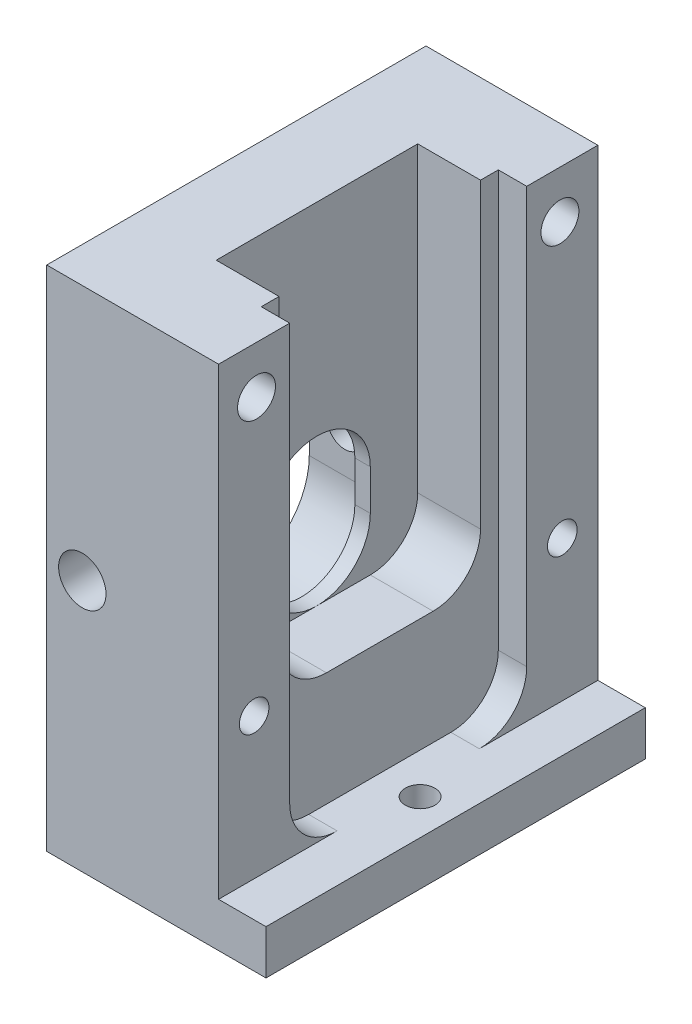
ISO-10303-21;
HEADER;
FILE_DESCRIPTION(('STEP AP214'),'2;1');
FILE_NAME('part.step','',(''),(''),'','','');
FILE_SCHEMA(('AUTOMOTIVE_DESIGN { 1 0 10303 214 1 1 1 1 }'));
ENDSEC;
DATA;
#1=APPLICATION_CONTEXT('core data for automotive mechanical design processes');
#2=APPLICATION_PROTOCOL_DEFINITION('international standard','automotive_design',2000,#1);
#3=PRODUCT_CONTEXT('',#1,'mechanical');
#4=PRODUCT('Part','Part','',(#3));
#5=PRODUCT_RELATED_PRODUCT_CATEGORY('part','',(#4));
#6=PRODUCT_DEFINITION_FORMATION('','',#4);
#7=PRODUCT_DEFINITION_CONTEXT('part definition',#1,'design');
#8=PRODUCT_DEFINITION('design','',#6,#7);
#9=PRODUCT_DEFINITION_SHAPE('','',#8);
#10=(LENGTH_UNIT() NAMED_UNIT(*) SI_UNIT(.MILLI.,.METRE.));
#11=(NAMED_UNIT(*) PLANE_ANGLE_UNIT() SI_UNIT($,.RADIAN.));
#12=(NAMED_UNIT(*) SI_UNIT($,.STERADIAN.) SOLID_ANGLE_UNIT());
#13=UNCERTAINTY_MEASURE_WITH_UNIT(LENGTH_MEASURE(1.E-05),#10,'distance_accuracy_value','');
#14=(GEOMETRIC_REPRESENTATION_CONTEXT(3) GLOBAL_UNCERTAINTY_ASSIGNED_CONTEXT((#13)) GLOBAL_UNIT_ASSIGNED_CONTEXT((#10,
#11,#12)) REPRESENTATION_CONTEXT('',''));
#15=CARTESIAN_POINT('',(0.,0.,0.));
#16=DIRECTION('',(0.,0.,1.));
#17=DIRECTION('',(1.,0.,0.));
#18=AXIS2_PLACEMENT_3D('',#15,#16,#17);
#19=CARTESIAN_POINT('',(0.,0.,32.));
#20=DIRECTION('',(1.,0.,0.));
#21=DIRECTION('',(0.,0.,-1.));
#22=AXIS2_PLACEMENT_3D('',#19,#20,#21);
#23=PLANE('',#22);
#24=CARTESIAN_POINT('',(0.,38.85,28.8));
#25=DIRECTION('',(1.,0.,0.));
#26=DIRECTION('',(0.,0.,-1.));
#27=AXIS2_PLACEMENT_3D('',#24,#25,#26);
#28=CIRCLE('',#27,3.1);
#29=CARTESIAN_POINT('',(0.,38.85,25.7));
#30=VERTEX_POINT('',#29);
#31=EDGE_CURVE('E692',#30,#30,#28,.T.);
#32=ORIENTED_EDGE('',*,*,#31,.T.);
#33=EDGE_LOOP('',(#32));
#34=FACE_BOUND('',#33,.T.);
#35=DIRECTION('',(0.,-1.,0.));
#36=VECTOR('',#35,1.);
#37=CARTESIAN_POINT('',(0.,21.25,9.85));
#38=LINE('',#37,#36);
#39=CARTESIAN_POINT('',(0.,21.25,9.85));
#40=VERTEX_POINT('',#39);
#41=CARTESIAN_POINT('',(0.,17.85,9.85));
#42=VERTEX_POINT('',#41);
#43=EDGE_CURVE('E296',#40,#42,#38,.T.);
#44=ORIENTED_EDGE('',*,*,#43,.F.);
#45=CARTESIAN_POINT('',(0.,21.25,16.));
#46=DIRECTION('',(-1.,0.,0.));
#47=DIRECTION('',(0.,0.,1.));
#48=AXIS2_PLACEMENT_3D('',#45,#46,#47);
#49=CIRCLE('',#48,6.15);
#50=CARTESIAN_POINT('',(0.,21.25,22.15));
#51=VERTEX_POINT('',#50);
#52=EDGE_CURVE('E293',#51,#40,#49,.T.);
#53=ORIENTED_EDGE('',*,*,#52,.F.);
#54=DIRECTION('',(0.,1.,0.));
#55=VECTOR('',#54,1.);
#56=CARTESIAN_POINT('',(0.,21.25,22.15));
#57=LINE('',#56,#55);
#58=CARTESIAN_POINT('',(0.,17.85,22.15));
#59=VERTEX_POINT('',#58);
#60=EDGE_CURVE('E302',#59,#51,#57,.T.);
#61=ORIENTED_EDGE('',*,*,#60,.F.);
#62=CARTESIAN_POINT('',(0.,17.85,16.));
#63=DIRECTION('',(-1.,0.,0.));
#64=DIRECTION('',(0.,0.,1.));
#65=AXIS2_PLACEMENT_3D('',#62,#63,#64);
#66=CIRCLE('',#65,6.15);
#67=EDGE_CURVE('E299',#42,#59,#66,.T.);
#68=ORIENTED_EDGE('',*,*,#67,.F.);
#69=EDGE_LOOP('',(#44,#53,#61,#68));
#70=FACE_BOUND('',#69,.T.);
#71=DIRECTION('',(0.,-1.,0.));
#72=VECTOR('',#71,1.);
#73=CARTESIAN_POINT('',(0.,0.,0.));
#74=LINE('',#73,#72);
#75=CARTESIAN_POINT('',(0.,42.85,0.));
#76=VERTEX_POINT('',#75);
#77=CARTESIAN_POINT('',(0.,0.,0.));
#78=VERTEX_POINT('',#77);
#79=EDGE_CURVE('E418',#76,#78,#74,.T.);
#80=ORIENTED_EDGE('',*,*,#79,.T.);
#81=DIRECTION('',(0.,0.,-1.));
#82=VECTOR('',#81,1.);
#83=CARTESIAN_POINT('',(0.,0.,32.));
#84=LINE('',#83,#82);
#85=CARTESIAN_POINT('',(0.,0.,32.));
#86=VERTEX_POINT('',#85);
#87=EDGE_CURVE('E433',#86,#78,#84,.T.);
#88=ORIENTED_EDGE('',*,*,#87,.F.);
#89=DIRECTION('',(0.,-1.,0.));
#90=VECTOR('',#89,1.);
#91=CARTESIAN_POINT('',(0.,0.,32.));
#92=LINE('',#91,#90);
#93=CARTESIAN_POINT('',(0.,42.85,32.));
#94=VERTEX_POINT('',#93);
#95=EDGE_CURVE('E431',#94,#86,#92,.T.);
#96=ORIENTED_EDGE('',*,*,#95,.F.);
#97=DIRECTION('',(0.,0.,-1.));
#98=VECTOR('',#97,1.);
#99=CARTESIAN_POINT('',(0.,42.85,32.));
#100=LINE('',#99,#98);
#101=EDGE_CURVE('E436',#94,#76,#100,.T.);
#102=ORIENTED_EDGE('',*,*,#101,.T.);
#103=EDGE_LOOP('',(#80,#88,#96,#102));
#104=FACE_BOUND('',#103,.T.);
#105=CARTESIAN_POINT('',(0.,38.85,3.19999999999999));
#106=DIRECTION('',(-1.,0.,0.));
#107=DIRECTION('',(0.,0.,1.));
#108=AXIS2_PLACEMENT_3D('',#105,#106,#107);
#109=CIRCLE('',#108,3.1);
#110=CARTESIAN_POINT('',(0.,38.85,6.29999999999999));
#111=VERTEX_POINT('',#110);
#112=EDGE_CURVE('E679',#111,#111,#109,.T.);
#113=ORIENTED_EDGE('',*,*,#112,.F.);
#114=EDGE_LOOP('',(#113));
#115=FACE_BOUND('',#114,.T.);
#116=ADVANCED_FACE('F29',(#34,#70,#104,#115),#23,.F.);
#117=CARTESIAN_POINT('',(14.5,42.85,32.));
#118=DIRECTION('',(-1.,0.,0.));
#119=DIRECTION('',(0.,-1.,0.));
#120=AXIS2_PLACEMENT_3D('',#117,#118,#119);
#121=PLANE('',#120);
#122=DIRECTION('',(0.,0.,-1.));
#123=VECTOR('',#122,1.);
#124=CARTESIAN_POINT('',(14.5,42.85,32.));
#125=LINE('',#124,#123);
#126=CARTESIAN_POINT('',(14.5,42.85,6.));
#127=VERTEX_POINT('',#126);
#128=CARTESIAN_POINT('',(14.5,42.85,0.));
#129=VERTEX_POINT('',#128);
#130=EDGE_CURVE('E439',#127,#129,#125,.T.);
#131=ORIENTED_EDGE('',*,*,#130,.F.);
#132=DIRECTION('',(0.,1.,0.));
#133=VECTOR('',#132,1.);
#134=CARTESIAN_POINT('',(14.5,42.85,6.));
#135=LINE('',#134,#133);
#136=CARTESIAN_POINT('',(14.5,7.74999999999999,6.));
#137=VERTEX_POINT('',#136);
#138=EDGE_CURVE('E357',#137,#127,#135,.T.);
#139=ORIENTED_EDGE('',*,*,#138,.F.);
#140=CARTESIAN_POINT('',(14.5,7.74999999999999,10.));
#141=DIRECTION('',(-1.,0.,0.));
#142=DIRECTION('',(0.,-1.,0.));
#143=AXIS2_PLACEMENT_3D('',#140,#141,#142);
#144=CIRCLE('',#143,4.);
#145=CARTESIAN_POINT('',(14.5,3.75,10.));
#146=VERTEX_POINT('',#145);
#147=EDGE_CURVE('E481',#137,#146,#144,.T.);
#148=ORIENTED_EDGE('',*,*,#147,.T.);
#149=DIRECTION('',(0.,0.,-1.));
#150=VECTOR('',#149,1.);
#151=CARTESIAN_POINT('',(14.5,3.75,32.));
#152=LINE('',#151,#150);
#153=CARTESIAN_POINT('',(14.5,3.75,0.));
#154=VERTEX_POINT('',#153);
#155=EDGE_CURVE('E443',#146,#154,#152,.T.);
#156=ORIENTED_EDGE('',*,*,#155,.T.);
#157=DIRECTION('',(0.,1.,0.));
#158=VECTOR('',#157,1.);
#159=CARTESIAN_POINT('',(14.5,42.85,0.));
#160=LINE('',#159,#158);
#161=EDGE_CURVE('E413',#154,#129,#160,.T.);
#162=ORIENTED_EDGE('',*,*,#161,.T.);
#163=EDGE_LOOP('',(#131,#139,#148,#156,#162));
#164=FACE_BOUND('',#163,.T.);
#165=CARTESIAN_POINT('',(14.5,15.65,3.));
#166=DIRECTION('',(1.,0.,0.));
#167=DIRECTION('',(0.,0.,-1.));
#168=AXIS2_PLACEMENT_3D('',#165,#166,#167);
#169=CIRCLE('',#168,1.24999999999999);
#170=CARTESIAN_POINT('',(14.5,15.65,1.75000000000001));
#171=VERTEX_POINT('',#170);
#172=EDGE_CURVE('E245',#171,#171,#169,.T.);
#173=ORIENTED_EDGE('',*,*,#172,.F.);
#174=EDGE_LOOP('',(#173));
#175=FACE_BOUND('',#174,.T.);
#176=CARTESIAN_POINT('',(14.5,38.85,3.19999999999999));
#177=DIRECTION('',(-1.,0.,0.));
#178=DIRECTION('',(0.,0.,1.));
#179=AXIS2_PLACEMENT_3D('',#176,#177,#178);
#180=CIRCLE('',#179,1.6);
#181=CARTESIAN_POINT('',(14.5,38.85,4.79999999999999));
#182=VERTEX_POINT('',#181);
#183=EDGE_CURVE('E689',#182,#182,#180,.T.);
#184=ORIENTED_EDGE('',*,*,#183,.T.);
#185=EDGE_LOOP('',(#184));
#186=FACE_BOUND('',#185,.T.);
#187=ADVANCED_FACE('F505',(#164,#175,#186),#121,.F.);
#188=CARTESIAN_POINT('',(14.5,3.75,32.));
#189=VERTEX_POINT('',#188);
#190=CARTESIAN_POINT('',(14.5,3.75,22.));
#191=VERTEX_POINT('',#190);
#192=EDGE_CURVE('E444',#189,#191,#152,.T.);
#193=ORIENTED_EDGE('',*,*,#192,.T.);
#194=CARTESIAN_POINT('',(14.5,7.75,22.));
#195=DIRECTION('',(-1.,0.,0.));
#196=DIRECTION('',(0.,-1.,0.));
#197=AXIS2_PLACEMENT_3D('',#194,#195,#196);
#198=CIRCLE('',#197,4.);
#199=CARTESIAN_POINT('',(14.5,7.74999999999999,26.));
#200=VERTEX_POINT('',#199);
#201=EDGE_CURVE('E484',#191,#200,#198,.T.);
#202=ORIENTED_EDGE('',*,*,#201,.T.);
#203=DIRECTION('',(0.,-1.,0.));
#204=VECTOR('',#203,1.);
#205=CARTESIAN_POINT('',(14.5,42.85,26.));
#206=LINE('',#205,#204);
#207=CARTESIAN_POINT('',(14.5,42.85,26.));
#208=VERTEX_POINT('',#207);
#209=EDGE_CURVE('E349',#208,#200,#206,.T.);
#210=ORIENTED_EDGE('',*,*,#209,.F.);
#211=CARTESIAN_POINT('',(14.5,42.85,32.));
#212=VERTEX_POINT('',#211);
#213=EDGE_CURVE('E440',#212,#208,#125,.T.);
#214=ORIENTED_EDGE('',*,*,#213,.F.);
#215=DIRECTION('',(0.,1.,0.));
#216=VECTOR('',#215,1.);
#217=CARTESIAN_POINT('',(14.5,42.85,32.));
#218=LINE('',#217,#216);
#219=EDGE_CURVE('E427',#189,#212,#218,.T.);
#220=ORIENTED_EDGE('',*,*,#219,.F.);
#221=EDGE_LOOP('',(#193,#202,#210,#214,#220));
#222=FACE_BOUND('',#221,.T.);
#223=CARTESIAN_POINT('',(14.5,15.65,29.));
#224=DIRECTION('',(1.,0.,0.));
#225=DIRECTION('',(0.,0.,-1.));
#226=AXIS2_PLACEMENT_3D('',#223,#224,#225);
#227=CIRCLE('',#226,1.24999999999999);
#228=CARTESIAN_POINT('',(14.5,15.65,27.75));
#229=VERTEX_POINT('',#228);
#230=EDGE_CURVE('E232',#229,#229,#227,.T.);
#231=ORIENTED_EDGE('',*,*,#230,.F.);
#232=EDGE_LOOP('',(#231));
#233=FACE_BOUND('',#232,.T.);
#234=CARTESIAN_POINT('',(14.5,38.85,28.8));
#235=DIRECTION('',(1.,0.,0.));
#236=DIRECTION('',(0.,0.,-1.));
#237=AXIS2_PLACEMENT_3D('',#234,#235,#236);
#238=CIRCLE('',#237,1.6);
#239=CARTESIAN_POINT('',(14.5,38.85,27.2));
#240=VERTEX_POINT('',#239);
#241=EDGE_CURVE('E233',#240,#240,#238,.T.);
#242=ORIENTED_EDGE('',*,*,#241,.F.);
#243=EDGE_LOOP('',(#242));
#244=FACE_BOUND('',#243,.T.);
#245=ADVANCED_FACE('F501',(#222,#233,#244),#121,.F.);
#246=CARTESIAN_POINT('',(0.,0.,0.));
#247=DIRECTION('',(0.,0.,-1.));
#248=DIRECTION('',(-1.,0.,0.));
#249=AXIS2_PLACEMENT_3D('',#246,#247,#248);
#250=PLANE('',#249);
#251=DIRECTION('',(1.,0.,0.));
#252=VECTOR('',#251,1.);
#253=CARTESIAN_POINT('',(18.5,0.,0.));
#254=LINE('',#253,#252);
#255=CARTESIAN_POINT('',(18.5,0.,0.));
#256=VERTEX_POINT('',#255);
#257=EDGE_CURVE('E403',#78,#256,#254,.T.);
#258=ORIENTED_EDGE('',*,*,#257,.F.);
#259=ORIENTED_EDGE('',*,*,#79,.F.);
#260=DIRECTION('',(-1.,0.,0.));
#261=VECTOR('',#260,1.);
#262=CARTESIAN_POINT('',(0.,42.85,0.));
#263=LINE('',#262,#261);
#264=EDGE_CURVE('E416',#129,#76,#263,.T.);
#265=ORIENTED_EDGE('',*,*,#264,.F.);
#266=ORIENTED_EDGE('',*,*,#161,.F.);
#267=DIRECTION('',(-1.,0.,0.));
#268=VECTOR('',#267,1.);
#269=CARTESIAN_POINT('',(14.5,3.75,0.));
#270=LINE('',#269,#268);
#271=CARTESIAN_POINT('',(18.5,3.75,0.));
#272=VERTEX_POINT('',#271);
#273=EDGE_CURVE('E410',#272,#154,#270,.T.);
#274=ORIENTED_EDGE('',*,*,#273,.F.);
#275=DIRECTION('',(0.,1.,0.));
#276=VECTOR('',#275,1.);
#277=CARTESIAN_POINT('',(18.5,3.75,0.));
#278=LINE('',#277,#276);
#279=EDGE_CURVE('E408',#256,#272,#278,.T.);
#280=ORIENTED_EDGE('',*,*,#279,.F.);
#281=EDGE_LOOP('',(#258,#259,#265,#266,#274,#280));
#282=FACE_BOUND('',#281,.T.);
#283=CARTESIAN_POINT('',(3.,21.3,0.));
#284=DIRECTION('',(0.,0.,1.));
#285=DIRECTION('',(1.,0.,0.));
#286=AXIS2_PLACEMENT_3D('',#283,#284,#285);
#287=CIRCLE('',#286,2.);
#288=CARTESIAN_POINT('',(5.,21.3,0.));
#289=VERTEX_POINT('',#288);
#290=EDGE_CURVE('E251',#289,#289,#287,.T.);
#291=ORIENTED_EDGE('',*,*,#290,.T.);
#292=EDGE_LOOP('',(#291));
#293=FACE_BOUND('',#292,.T.);
#294=ADVANCED_FACE('F497',(#282,#293),#250,.T.);
#295=CARTESIAN_POINT('',(3.,21.3,0.));
#296=DIRECTION('',(0.,0.,1.));
#297=DIRECTION('',(1.,0.,0.));
#298=AXIS2_PLACEMENT_3D('',#295,#296,#297);
#299=CYLINDRICAL_SURFACE('',#298,1.5);
#300=CARTESIAN_POINT('',(3.,21.3,9.85));
#301=DIRECTION('',(0.,0.,-1.));
#302=DIRECTION('',(-1.,0.,0.));
#303=AXIS2_PLACEMENT_3D('',#300,#301,#302);
#304=CIRCLE('',#303,1.5);
#305=CARTESIAN_POINT('',(4.4991664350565,21.25,9.85));
#306=VERTEX_POINT('',#305);
#307=CARTESIAN_POINT('',(1.5008335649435,21.25,9.85));
#308=VERTEX_POINT('',#307);
#309=EDGE_CURVE('E11',#306,#308,#304,.T.);
#310=ORIENTED_EDGE('',*,*,#309,.F.);
#311=CARTESIAN_POINT('',(1.5008335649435,21.25,9.84999999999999));
#312=CARTESIAN_POINT('',(1.49944944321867,21.291488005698,9.84999769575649));
#313=CARTESIAN_POINT('',(1.49979015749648,21.3330131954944,9.8504203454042));
#314=CARTESIAN_POINT('',(1.50390649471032,21.4158701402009,9.85209791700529));
#315=CARTESIAN_POINT('',(1.50768162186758,21.457201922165,9.85335271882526));
#316=CARTESIAN_POINT('',(1.52410646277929,21.5802974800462,9.85832995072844));
#317=CARTESIAN_POINT('',(1.54184823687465,21.6613925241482,9.86326540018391));
#318=CARTESIAN_POINT('',(1.59033764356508,21.8193129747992,9.87589381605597));
#319=CARTESIAN_POINT('',(1.62108540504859,21.8961383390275,9.88358680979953));
#320=CARTESIAN_POINT('',(1.69465573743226,22.0435460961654,9.90095950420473));
#321=CARTESIAN_POINT('',(1.7374808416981,22.1141271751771,9.91063962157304));
#322=CARTESIAN_POINT('',(1.83486562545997,22.2483995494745,9.93119456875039));
#323=CARTESIAN_POINT('',(1.88961791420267,22.3119483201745,9.9420873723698));
#324=CARTESIAN_POINT('',(2.00894802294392,22.4290736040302,9.96378923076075));
#325=CARTESIAN_POINT('',(2.07352786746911,22.4826480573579,9.97459826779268));
#326=CARTESIAN_POINT('',(2.21198271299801,22.5791658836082,9.99514362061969));
#327=CARTESIAN_POINT('',(2.28599344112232,22.6219193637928,10.0048593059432));
#328=CARTESIAN_POINT('',(2.44042089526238,22.6943242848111,10.0218883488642));
#329=CARTESIAN_POINT('',(2.52083637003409,22.7239782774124,10.0292021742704));
#330=CARTESIAN_POINT('',(2.68426911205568,22.7687963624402,10.0404457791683));
#331=CARTESIAN_POINT('',(2.76721298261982,22.7842129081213,10.0444343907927));
#332=CARTESIAN_POINT('',(2.93460102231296,22.8009311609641,10.0487656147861));
#333=CARTESIAN_POINT('',(3.019044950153,22.8022351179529,10.0491088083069));
#334=CARTESIAN_POINT('',(3.1846691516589,22.7908411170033,10.0461492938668));
#335=CARTESIAN_POINT('',(3.26587680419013,22.778511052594,10.0429423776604));
#336=CARTESIAN_POINT('',(3.42502172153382,22.7408483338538,10.0334059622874));
#337=CARTESIAN_POINT('',(3.50295887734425,22.7155152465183,10.0270763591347));
#338=CARTESIAN_POINT('',(3.65395980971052,22.6524333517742,10.0119508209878));
#339=CARTESIAN_POINT('',(3.7269891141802,22.6146059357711,10.0031393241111));
#340=CARTESIAN_POINT('',(3.86577085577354,22.5276599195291,9.9840162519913));
#341=CARTESIAN_POINT('',(3.93152193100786,22.4785392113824,9.97370439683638));
#342=CARTESIAN_POINT('',(4.05590432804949,22.3687129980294,9.95233977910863));
#343=CARTESIAN_POINT('',(4.11427264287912,22.307711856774,9.94127418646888));
#344=CARTESIAN_POINT('',(4.22002898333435,22.1767073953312,9.91985930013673));
#345=CARTESIAN_POINT('',(4.2674154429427,22.106702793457,9.90951010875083));
#346=CARTESIAN_POINT('',(4.35021609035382,21.9589048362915,9.89053607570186));
#347=CARTESIAN_POINT('',(4.38552226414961,21.8810488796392,9.88192705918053));
#348=CARTESIAN_POINT('',(4.44243836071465,21.7202696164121,9.86747713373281));
#349=CARTESIAN_POINT('',(4.46406082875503,21.637351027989,9.8616336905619));
#350=CARTESIAN_POINT('',(4.48704546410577,21.5031694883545,9.85500818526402));
#351=CARTESIAN_POINT('',(4.4930684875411,21.4527135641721,9.85313449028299));
#352=CARTESIAN_POINT('',(4.49997393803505,21.3514849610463,9.85062774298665));
#353=CARTESIAN_POINT('',(4.5008628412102,21.3007127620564,9.84999312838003));
#354=CARTESIAN_POINT('',(4.4991664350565,21.25,9.84999999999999));
#355=B_SPLINE_CURVE_WITH_KNOTS('',3,(#311,#312,#313,#314,#315,#316,#317,#318,#319,#320,#321,
#322,#323,#324,#325,#326,#327,#328,#329,#330,#331,#332,#333,#334,#335,#336,#337,#338,#339,#340,
#341,#342,#343,#344,#345,#346,#347,#348,#349,#350,#351,#352,#353,#354),.UNSPECIFIED.,.F.,.F.,(4,
2,2,2,2,2,2,2,2,2,2,2,2,2,2,2,2,2,2,2,2,4),(0.,0.124455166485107,0.248892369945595,
0.497082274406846,0.745274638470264,0.993519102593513,1.24611680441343,1.49876661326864,
1.75558298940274,2.01234931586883,2.26447006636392,2.51655062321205,2.76199159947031,
3.00744074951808,3.25446454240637,3.50153448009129,3.75579739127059,4.01009653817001,
4.26661342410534,4.52289479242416,4.6751888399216,4.82729074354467),.UNSPECIFIED.);
#356=EDGE_CURVE('E52',#308,#306,#355,.T.);
#357=ORIENTED_EDGE('',*,*,#356,.F.);
#358=EDGE_LOOP('',(#310,#357));
#359=FACE_BOUND('',#358,.T.);
#360=CARTESIAN_POINT('',(3.,21.3,3.74999999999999));
#361=DIRECTION('',(0.,0.,-1.));
#362=DIRECTION('',(-1.,0.,0.));
#363=AXIS2_PLACEMENT_3D('',#360,#361,#362);
#364=CIRCLE('',#363,1.5);
#365=CARTESIAN_POINT('',(1.5,21.3,3.74999999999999));
#366=VERTEX_POINT('',#365);
#367=EDGE_CURVE('E257',#366,#366,#364,.F.);
#368=ORIENTED_EDGE('',*,*,#367,.F.);
#369=EDGE_LOOP('',(#368));
#370=FACE_BOUND('',#369,.T.);
#371=ADVANCED_FACE('F283',(#359,#370),#299,.F.);
#372=CARTESIAN_POINT('',(3.,21.3,22.15));
#373=DIRECTION('',(0.,0.,1.));
#374=DIRECTION('',(1.,0.,0.));
#375=AXIS2_PLACEMENT_3D('',#372,#373,#374);
#376=CIRCLE('',#375,1.5);
#377=CARTESIAN_POINT('',(1.5008335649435,21.25,22.15));
#378=VERTEX_POINT('',#377);
#379=CARTESIAN_POINT('',(4.4991664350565,21.25,22.15));
#380=VERTEX_POINT('',#379);
#381=EDGE_CURVE('E271',#378,#380,#376,.T.);
#382=ORIENTED_EDGE('',*,*,#381,.F.);
#383=CARTESIAN_POINT('',(4.4991664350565,21.25,22.15));
#384=CARTESIAN_POINT('',(4.50055055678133,21.291488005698,22.1500023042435));
#385=CARTESIAN_POINT('',(4.50020984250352,21.3330131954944,22.1495796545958));
#386=CARTESIAN_POINT('',(4.49609350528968,21.4158701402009,22.1479020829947));
#387=CARTESIAN_POINT('',(4.49231837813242,21.457201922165,22.1466472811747));
#388=CARTESIAN_POINT('',(4.47589353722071,21.5802974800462,22.1416700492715));
#389=CARTESIAN_POINT('',(4.45815176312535,21.6613925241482,22.1367345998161));
#390=CARTESIAN_POINT('',(4.40966235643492,21.8193129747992,22.124106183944));
#391=CARTESIAN_POINT('',(4.37891459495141,21.8961383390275,22.1164131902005));
#392=CARTESIAN_POINT('',(4.30534426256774,22.0435460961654,22.0990404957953));
#393=CARTESIAN_POINT('',(4.26251915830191,22.1141271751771,22.0893603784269));
#394=CARTESIAN_POINT('',(4.16513437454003,22.2483995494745,22.0688054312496));
#395=CARTESIAN_POINT('',(4.11038208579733,22.3119483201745,22.0579126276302));
#396=CARTESIAN_POINT('',(3.99105197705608,22.4290736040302,22.0362107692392));
#397=CARTESIAN_POINT('',(3.92647213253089,22.4826480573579,22.0254017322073));
#398=CARTESIAN_POINT('',(3.788017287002,22.5791658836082,22.0048563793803));
#399=CARTESIAN_POINT('',(3.71400655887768,22.6219193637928,21.9951406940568));
#400=CARTESIAN_POINT('',(3.55957910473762,22.6943242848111,21.9781116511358));
#401=CARTESIAN_POINT('',(3.47916362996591,22.7239782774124,21.9707978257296));
#402=CARTESIAN_POINT('',(3.31573088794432,22.7687963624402,21.9595542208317));
#403=CARTESIAN_POINT('',(3.23278701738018,22.7842129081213,21.9555656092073));
#404=CARTESIAN_POINT('',(3.06539897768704,22.8009311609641,21.9512343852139));
#405=CARTESIAN_POINT('',(2.980955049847,22.8022351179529,21.9508911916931));
#406=CARTESIAN_POINT('',(2.8153308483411,22.7908411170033,21.9538507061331));
#407=CARTESIAN_POINT('',(2.73412319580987,22.778511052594,21.9570576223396));
#408=CARTESIAN_POINT('',(2.57497827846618,22.7408483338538,21.9665940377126));
#409=CARTESIAN_POINT('',(2.49704112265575,22.7155152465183,21.9729236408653));
#410=CARTESIAN_POINT('',(2.34604019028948,22.6524333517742,21.9880491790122));
#411=CARTESIAN_POINT('',(2.2730108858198,22.6146059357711,21.9968606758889));
#412=CARTESIAN_POINT('',(2.13422914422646,22.5276599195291,22.0159837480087));
#413=CARTESIAN_POINT('',(2.06847806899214,22.4785392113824,22.0262956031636));
#414=CARTESIAN_POINT('',(1.94409567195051,22.3687129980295,22.0476602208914));
#415=CARTESIAN_POINT('',(1.88572735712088,22.307711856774,22.0587258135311));
#416=CARTESIAN_POINT('',(1.77997101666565,22.1767073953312,22.0801406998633));
#417=CARTESIAN_POINT('',(1.7325845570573,22.106702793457,22.0904898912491));
#418=CARTESIAN_POINT('',(1.64978390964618,21.9589048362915,22.1094639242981));
#419=CARTESIAN_POINT('',(1.61447773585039,21.8810488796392,22.1180729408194));
#420=CARTESIAN_POINT('',(1.55756163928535,21.7202696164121,22.1325228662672));
#421=CARTESIAN_POINT('',(1.53593917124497,21.637351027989,22.1383663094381));
#422=CARTESIAN_POINT('',(1.51295453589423,21.5031694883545,22.144991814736));
#423=CARTESIAN_POINT('',(1.5069315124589,21.4527135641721,22.146865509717));
#424=CARTESIAN_POINT('',(1.50002606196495,21.3514849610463,22.1493722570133));
#425=CARTESIAN_POINT('',(1.4991371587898,21.3007127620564,22.1500068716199));
#426=CARTESIAN_POINT('',(1.5008335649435,21.25,22.15));
#427=B_SPLINE_CURVE_WITH_KNOTS('',3,(#383,#384,#385,#386,#387,#388,#389,#390,#391,#392,#393,
#394,#395,#396,#397,#398,#399,#400,#401,#402,#403,#404,#405,#406,#407,#408,#409,#410,#411,#412,
#413,#414,#415,#416,#417,#418,#419,#420,#421,#422,#423,#424,#425,#426),.UNSPECIFIED.,.F.,.F.,(4,
2,2,2,2,2,2,2,2,2,2,2,2,2,2,2,2,2,2,2,2,4),(0.,0.124455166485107,0.248892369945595,
0.497082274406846,0.745274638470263,0.993519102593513,1.24611680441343,1.49876661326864,
1.75558298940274,2.01234931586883,2.26447006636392,2.51655062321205,2.76199159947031,
3.00744074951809,3.25446454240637,3.50153448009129,3.75579739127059,4.01009653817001,
4.26661342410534,4.52289479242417,4.6751888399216,4.82729074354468),.UNSPECIFIED.);
#428=EDGE_CURVE('E45',#380,#378,#427,.T.);
#429=ORIENTED_EDGE('',*,*,#428,.F.);
#430=EDGE_LOOP('',(#382,#429));
#431=FACE_BOUND('',#430,.T.);
#432=CARTESIAN_POINT('',(3.,21.3,28.25));
#433=DIRECTION('',(0.,0.,1.));
#434=DIRECTION('',(1.,0.,0.));
#435=AXIS2_PLACEMENT_3D('',#432,#433,#434);
#436=CIRCLE('',#435,1.5);
#437=CARTESIAN_POINT('',(4.5,21.3,28.25));
#438=VERTEX_POINT('',#437);
#439=EDGE_CURVE('E264',#438,#438,#436,.F.);
#440=ORIENTED_EDGE('',*,*,#439,.F.);
#441=EDGE_LOOP('',(#440));
#442=FACE_BOUND('',#441,.T.);
#443=ADVANCED_FACE('F277',(#431,#442),#299,.F.);
#444=CARTESIAN_POINT('',(0.,17.85,16.));
#445=DIRECTION('',(1.,0.,0.));
#446=DIRECTION('',(0.,1.,0.));
#447=AXIS2_PLACEMENT_3D('',#444,#445,#446);
#448=CYLINDRICAL_SURFACE('',#447,4.5);
#449=CARTESIAN_POINT('',(5.5,17.85,16.));
#450=DIRECTION('',(-1.,0.,0.));
#451=DIRECTION('',(0.,0.,1.));
#452=AXIS2_PLACEMENT_3D('',#449,#450,#451);
#453=CIRCLE('',#452,4.5);
#454=CARTESIAN_POINT('',(5.5,17.85,20.5));
#455=VERTEX_POINT('',#454);
#456=CARTESIAN_POINT('',(5.5,17.85,11.5));
#457=VERTEX_POINT('',#456);
#458=EDGE_CURVE('E333',#455,#457,#453,.F.);
#459=ORIENTED_EDGE('',*,*,#458,.F.);
#460=DIRECTION('',(1.,0.,0.));
#461=VECTOR('',#460,1.);
#462=CARTESIAN_POINT('',(0.,17.85,20.5));
#463=LINE('',#462,#461);
#464=CARTESIAN_POINT('',(6.8,17.85,20.5));
#465=VERTEX_POINT('',#464);
#466=EDGE_CURVE('E347',#455,#465,#463,.T.);
#467=ORIENTED_EDGE('',*,*,#466,.T.);
#468=CARTESIAN_POINT('',(6.8,17.85,16.));
#469=DIRECTION('',(1.,0.,0.));
#470=DIRECTION('',(0.,1.,0.));
#471=AXIS2_PLACEMENT_3D('',#468,#469,#470);
#472=CIRCLE('',#471,4.5);
#473=CARTESIAN_POINT('',(6.80000000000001,13.35,16.));
#474=VERTEX_POINT('',#473);
#475=EDGE_CURVE('E335',#465,#474,#472,.T.);
#476=ORIENTED_EDGE('',*,*,#475,.T.);
#477=CARTESIAN_POINT('',(6.8,17.85,16.));
#478=DIRECTION('',(1.,0.,0.));
#479=DIRECTION('',(0.,1.,0.));
#480=AXIS2_PLACEMENT_3D('',#477,#478,#479);
#481=CIRCLE('',#480,4.5);
#482=CARTESIAN_POINT('',(6.8,17.85,11.5));
#483=VERTEX_POINT('',#482);
#484=EDGE_CURVE('E486',#474,#483,#481,.T.);
#485=ORIENTED_EDGE('',*,*,#484,.T.);
#486=DIRECTION('',(1.,0.,0.));
#487=VECTOR('',#486,1.);
#488=CARTESIAN_POINT('',(0.,17.85,11.5));
#489=LINE('',#488,#487);
#490=EDGE_CURVE('E346',#457,#483,#489,.T.);
#491=ORIENTED_EDGE('',*,*,#490,.F.);
#492=EDGE_LOOP('',(#459,#467,#476,#485,#491));
#493=FACE_BOUND('',#492,.T.);
#494=ADVANCED_FACE('F282',(#493),#448,.F.);
#495=CARTESIAN_POINT('',(0.,17.85,20.5));
#496=DIRECTION('',(0.,0.,1.));
#497=DIRECTION('',(1.,0.,0.));
#498=AXIS2_PLACEMENT_3D('',#495,#496,#497);
#499=PLANE('',#498);
#500=DIRECTION('',(0.,-1.,0.));
#501=VECTOR('',#500,1.);
#502=CARTESIAN_POINT('',(5.5,17.85,20.5));
#503=LINE('',#502,#501);
#504=CARTESIAN_POINT('',(5.5,21.25,20.5));
#505=VERTEX_POINT('',#504);
#506=EDGE_CURVE('E331',#505,#455,#503,.T.);
#507=ORIENTED_EDGE('',*,*,#506,.F.);
#508=DIRECTION('',(1.,0.,0.));
#509=VECTOR('',#508,1.);
#510=CARTESIAN_POINT('',(0.,21.25,20.5));
#511=LINE('',#510,#509);
#512=CARTESIAN_POINT('',(6.8,21.25,20.5));
#513=VERTEX_POINT('',#512);
#514=EDGE_CURVE('E350',#505,#513,#511,.T.);
#515=ORIENTED_EDGE('',*,*,#514,.T.);
#516=DIRECTION('',(0.,-1.,0.));
#517=VECTOR('',#516,1.);
#518=CARTESIAN_POINT('',(6.8,17.85,20.5));
#519=LINE('',#518,#517);
#520=EDGE_CURVE('E343',#513,#465,#519,.T.);
#521=ORIENTED_EDGE('',*,*,#520,.T.);
#522=ORIENTED_EDGE('',*,*,#466,.F.);
#523=EDGE_LOOP('',(#507,#515,#521,#522));
#524=FACE_BOUND('',#523,.T.);
#525=ADVANCED_FACE('F629',(#524),#499,.F.);
#526=CARTESIAN_POINT('',(0.,21.25,16.));
#527=DIRECTION('',(1.,0.,0.));
#528=DIRECTION('',(0.,1.,0.));
#529=AXIS2_PLACEMENT_3D('',#526,#527,#528);
#530=CYLINDRICAL_SURFACE('',#529,4.5);
#531=CARTESIAN_POINT('',(5.5,21.25,16.));
#532=DIRECTION('',(-1.,0.,0.));
#533=DIRECTION('',(0.,0.,1.));
#534=AXIS2_PLACEMENT_3D('',#531,#532,#533);
#535=CIRCLE('',#534,4.5);
#536=CARTESIAN_POINT('',(5.5,21.25,11.5));
#537=VERTEX_POINT('',#536);
#538=EDGE_CURVE('E321',#537,#505,#535,.F.);
#539=ORIENTED_EDGE('',*,*,#538,.F.);
#540=DIRECTION('',(1.,0.,0.));
#541=VECTOR('',#540,1.);
#542=CARTESIAN_POINT('',(0.,21.25,11.5));
#543=LINE('',#542,#541);
#544=CARTESIAN_POINT('',(6.8,21.25,11.5));
#545=VERTEX_POINT('',#544);
#546=EDGE_CURVE('E352',#537,#545,#543,.T.);
#547=ORIENTED_EDGE('',*,*,#546,.T.);
#548=CARTESIAN_POINT('',(6.8,21.25,16.));
#549=DIRECTION('',(1.,0.,0.));
#550=DIRECTION('',(0.,1.,0.));
#551=AXIS2_PLACEMENT_3D('',#548,#549,#550);
#552=CIRCLE('',#551,4.5);
#553=EDGE_CURVE('E340',#545,#513,#552,.T.);
#554=ORIENTED_EDGE('',*,*,#553,.T.);
#555=ORIENTED_EDGE('',*,*,#514,.F.);
#556=EDGE_LOOP('',(#539,#547,#554,#555));
#557=FACE_BOUND('',#556,.T.);
#558=ADVANCED_FACE('F602',(#557),#530,.F.);
#559=CARTESIAN_POINT('',(0.,17.85,11.5));
#560=DIRECTION('',(0.,0.,-1.));
#561=DIRECTION('',(-1.,0.,0.));
#562=AXIS2_PLACEMENT_3D('',#559,#560,#561);
#563=PLANE('',#562);
#564=DIRECTION('',(0.,1.,0.));
#565=VECTOR('',#564,1.);
#566=CARTESIAN_POINT('',(5.5,17.85,11.5));
#567=LINE('',#566,#565);
#568=EDGE_CURVE('E38',#457,#537,#567,.T.);
#569=ORIENTED_EDGE('',*,*,#568,.F.);
#570=ORIENTED_EDGE('',*,*,#490,.T.);
#571=DIRECTION('',(0.,1.,0.));
#572=VECTOR('',#571,1.);
#573=CARTESIAN_POINT('',(6.8,17.85,11.5));
#574=LINE('',#573,#572);
#575=EDGE_CURVE('E337',#483,#545,#574,.T.);
#576=ORIENTED_EDGE('',*,*,#575,.T.);
#577=ORIENTED_EDGE('',*,*,#546,.F.);
#578=EDGE_LOOP('',(#569,#570,#576,#577));
#579=FACE_BOUND('',#578,.T.);
#580=ADVANCED_FACE('F595',(#579),#563,.F.);
#581=CARTESIAN_POINT('',(6.8,42.85,24.5));
#582=DIRECTION('',(0.,0.,1.));
#583=DIRECTION('',(0.,-1.,0.));
#584=AXIS2_PLACEMENT_3D('',#581,#582,#583);
#585=PLANE('',#584);
#586=DIRECTION('',(0.,1.,0.));
#587=VECTOR('',#586,1.);
#588=CARTESIAN_POINT('',(12.1,42.85,24.5));
#589=LINE('',#588,#587);
#590=CARTESIAN_POINT('',(12.1,17.35,24.5));
#591=VERTEX_POINT('',#590);
#592=CARTESIAN_POINT('',(12.1,42.85,24.5));
#593=VERTEX_POINT('',#592);
#594=EDGE_CURVE('E367',#591,#593,#589,.T.);
#595=ORIENTED_EDGE('',*,*,#594,.F.);
#596=DIRECTION('',(1.,0.,0.));
#597=VECTOR('',#596,1.);
#598=CARTESIAN_POINT('',(6.8,17.35,24.5));
#599=LINE('',#598,#597);
#600=CARTESIAN_POINT('',(6.8,17.35,24.5));
#601=VERTEX_POINT('',#600);
#602=EDGE_CURVE('E458',#591,#601,#599,.F.);
#603=ORIENTED_EDGE('',*,*,#602,.T.);
#604=DIRECTION('',(0.,-1.,0.));
#605=VECTOR('',#604,1.);
#606=CARTESIAN_POINT('',(6.8,42.85,24.5));
#607=LINE('',#606,#605);
#608=CARTESIAN_POINT('',(6.8,42.85,24.5));
#609=VERTEX_POINT('',#608);
#610=EDGE_CURVE('E386',#609,#601,#607,.T.);
#611=ORIENTED_EDGE('',*,*,#610,.F.);
#612=DIRECTION('',(1.,0.,0.));
#613=VECTOR('',#612,1.);
#614=CARTESIAN_POINT('',(6.8,42.85,24.5));
#615=LINE('',#614,#613);
#616=EDGE_CURVE('E400',#609,#593,#615,.T.);
#617=ORIENTED_EDGE('',*,*,#616,.T.);
#618=EDGE_LOOP('',(#595,#603,#611,#617));
#619=FACE_BOUND('',#618,.T.);
#620=ADVANCED_FACE('F593',(#619),#585,.F.);
#621=CARTESIAN_POINT('',(6.8,42.85,7.5));
#622=DIRECTION('',(0.,0.,-1.));
#623=DIRECTION('',(0.,1.,0.));
#624=AXIS2_PLACEMENT_3D('',#621,#622,#623);
#625=PLANE('',#624);
#626=DIRECTION('',(0.,-1.,0.));
#627=VECTOR('',#626,1.);
#628=CARTESIAN_POINT('',(12.1,17.35,7.5));
#629=LINE('',#628,#627);
#630=CARTESIAN_POINT('',(12.1,42.85,7.5));
#631=VERTEX_POINT('',#630);
#632=CARTESIAN_POINT('',(12.1,17.35,7.5));
#633=VERTEX_POINT('',#632);
#634=EDGE_CURVE('E359',#631,#633,#629,.T.);
#635=ORIENTED_EDGE('',*,*,#634,.F.);
#636=DIRECTION('',(1.,0.,0.));
#637=VECTOR('',#636,1.);
#638=CARTESIAN_POINT('',(6.8,42.85,7.5));
#639=LINE('',#638,#637);
#640=CARTESIAN_POINT('',(6.8,42.85,7.5));
#641=VERTEX_POINT('',#640);
#642=EDGE_CURVE('E399',#641,#631,#639,.T.);
#643=ORIENTED_EDGE('',*,*,#642,.F.);
#644=DIRECTION('',(0.,1.,0.));
#645=VECTOR('',#644,1.);
#646=CARTESIAN_POINT('',(6.8,42.85,7.5));
#647=LINE('',#646,#645);
#648=CARTESIAN_POINT('',(6.8,17.35,7.5));
#649=VERTEX_POINT('',#648);
#650=EDGE_CURVE('E394',#649,#641,#647,.T.);
#651=ORIENTED_EDGE('',*,*,#650,.F.);
#652=DIRECTION('',(1.,0.,0.));
#653=VECTOR('',#652,1.);
#654=CARTESIAN_POINT('',(14.5,17.35,7.5));
#655=LINE('',#654,#653);
#656=EDGE_CURVE('E464',#649,#633,#655,.T.);
#657=ORIENTED_EDGE('',*,*,#656,.T.);
#658=EDGE_LOOP('',(#635,#643,#651,#657));
#659=FACE_BOUND('',#658,.T.);
#660=ADVANCED_FACE('F568',(#659),#625,.F.);
#661=CARTESIAN_POINT('',(6.8,13.35,24.5));
#662=DIRECTION('',(0.,-1.,0.));
#663=DIRECTION('',(1.,0.,0.));
#664=AXIS2_PLACEMENT_3D('',#661,#662,#663);
#665=PLANE('',#664);
#666=DIRECTION('',(0.,0.,1.));
#667=VECTOR('',#666,1.);
#668=CARTESIAN_POINT('',(12.1,13.35,20.5));
#669=LINE('',#668,#667);
#670=CARTESIAN_POINT('',(12.1,13.35,11.5));
#671=VERTEX_POINT('',#670);
#672=CARTESIAN_POINT('',(12.1,13.35,20.5));
#673=VERTEX_POINT('',#672);
#674=EDGE_CURVE('E363',#671,#673,#669,.T.);
#675=ORIENTED_EDGE('',*,*,#674,.F.);
#676=DIRECTION('',(1.,0.,0.));
#677=VECTOR('',#676,1.);
#678=CARTESIAN_POINT('',(6.8,13.35,11.5));
#679=LINE('',#678,#677);
#680=CARTESIAN_POINT('',(6.8,13.35,11.5));
#681=VERTEX_POINT('',#680);
#682=EDGE_CURVE('E452',#671,#681,#679,.F.);
#683=ORIENTED_EDGE('',*,*,#682,.T.);
#684=DIRECTION('',(0.,0.,-1.));
#685=VECTOR('',#684,1.);
#686=CARTESIAN_POINT('',(6.8,13.35,24.5));
#687=LINE('',#686,#685);
#688=EDGE_CURVE('E390',#474,#681,#687,.T.);
#689=ORIENTED_EDGE('',*,*,#688,.F.);
#690=CARTESIAN_POINT('',(6.8,13.35,20.5));
#691=VERTEX_POINT('',#690);
#692=EDGE_CURVE('E391',#691,#474,#687,.T.);
#693=ORIENTED_EDGE('',*,*,#692,.F.);
#694=DIRECTION('',(1.,0.,0.));
#695=VECTOR('',#694,1.);
#696=CARTESIAN_POINT('',(14.5,13.35,20.5));
#697=LINE('',#696,#695);
#698=EDGE_CURVE('E455',#691,#673,#697,.T.);
#699=ORIENTED_EDGE('',*,*,#698,.T.);
#700=EDGE_LOOP('',(#675,#683,#689,#693,#699));
#701=FACE_BOUND('',#700,.T.);
#702=ADVANCED_FACE('F584',(#701),#665,.F.);
#703=CARTESIAN_POINT('',(6.8,17.35,20.5));
#704=DIRECTION('',(-1.,0.,0.));
#705=DIRECTION('',(0.,-1.,0.));
#706=AXIS2_PLACEMENT_3D('',#703,#704,#705);
#707=CYLINDRICAL_SURFACE('',#706,4.);
#708=CARTESIAN_POINT('',(12.1,17.35,20.5));
#709=DIRECTION('',(-1.,0.,0.));
#710=DIRECTION('',(0.,1.,0.));
#711=AXIS2_PLACEMENT_3D('',#708,#709,#710);
#712=CIRCLE('',#711,4.);
#713=EDGE_CURVE('E365',#673,#591,#712,.T.);
#714=ORIENTED_EDGE('',*,*,#713,.F.);
#715=ORIENTED_EDGE('',*,*,#698,.F.);
#716=CARTESIAN_POINT('',(6.8,17.35,20.5));
#717=DIRECTION('',(1.,0.,0.));
#718=DIRECTION('',(0.,1.,0.));
#719=AXIS2_PLACEMENT_3D('',#716,#717,#718);
#720=CIRCLE('',#719,4.);
#721=EDGE_CURVE('E462',#601,#691,#720,.T.);
#722=ORIENTED_EDGE('',*,*,#721,.F.);
#723=ORIENTED_EDGE('',*,*,#602,.F.);
#724=EDGE_LOOP('',(#714,#715,#722,#723));
#725=FACE_BOUND('',#724,.T.);
#726=ADVANCED_FACE('F589',(#725),#707,.F.);
#727=CARTESIAN_POINT('',(6.8,17.35,11.5));
#728=DIRECTION('',(-1.,0.,0.));
#729=DIRECTION('',(0.,-1.,0.));
#730=AXIS2_PLACEMENT_3D('',#727,#728,#729);
#731=CYLINDRICAL_SURFACE('',#730,4.);
#732=CARTESIAN_POINT('',(12.1,17.35,11.5));
#733=DIRECTION('',(-1.,0.,0.));
#734=DIRECTION('',(0.,1.,0.));
#735=AXIS2_PLACEMENT_3D('',#732,#733,#734);
#736=CIRCLE('',#735,4.);
#737=EDGE_CURVE('E361',#633,#671,#736,.T.);
#738=ORIENTED_EDGE('',*,*,#737,.F.);
#739=ORIENTED_EDGE('',*,*,#656,.F.);
#740=CARTESIAN_POINT('',(6.8,17.35,11.5));
#741=DIRECTION('',(1.,0.,0.));
#742=DIRECTION('',(0.,1.,0.));
#743=AXIS2_PLACEMENT_3D('',#740,#741,#742);
#744=CIRCLE('',#743,4.);
#745=EDGE_CURVE('E460',#681,#649,#744,.T.);
#746=ORIENTED_EDGE('',*,*,#745,.F.);
#747=ORIENTED_EDGE('',*,*,#682,.F.);
#748=EDGE_LOOP('',(#738,#739,#746,#747));
#749=FACE_BOUND('',#748,.T.);
#750=ADVANCED_FACE('F533',(#749),#731,.F.);
#751=CARTESIAN_POINT('',(18.5,0.,32.));
#752=DIRECTION('',(0.,1.,0.));
#753=DIRECTION('',(-1.,0.,0.));
#754=AXIS2_PLACEMENT_3D('',#751,#752,#753);
#755=PLANE('',#754);
#756=CARTESIAN_POINT('',(15.5,0.,16.));
#757=DIRECTION('',(0.,-1.,0.));
#758=DIRECTION('',(0.,0.,-1.));
#759=AXIS2_PLACEMENT_3D('',#756,#757,#758);
#760=CIRCLE('',#759,1.24999999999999);
#761=CARTESIAN_POINT('',(15.5,0.,14.75));
#762=VERTEX_POINT('',#761);
#763=EDGE_CURVE('E248',#762,#762,#760,.T.);
#764=ORIENTED_EDGE('',*,*,#763,.F.);
#765=EDGE_LOOP('',(#764));
#766=FACE_BOUND('',#765,.T.);
#767=ORIENTED_EDGE('',*,*,#257,.T.);
#768=DIRECTION('',(0.,0.,-1.));
#769=VECTOR('',#768,1.);
#770=CARTESIAN_POINT('',(18.5,0.,32.));
#771=LINE('',#770,#769);
#772=CARTESIAN_POINT('',(18.5,0.,32.));
#773=VERTEX_POINT('',#772);
#774=EDGE_CURVE('E449',#773,#256,#771,.T.);
#775=ORIENTED_EDGE('',*,*,#774,.F.);
#776=DIRECTION('',(1.,0.,0.));
#777=VECTOR('',#776,1.);
#778=CARTESIAN_POINT('',(18.5,0.,32.));
#779=LINE('',#778,#777);
#780=EDGE_CURVE('E420',#86,#773,#779,.T.);
#781=ORIENTED_EDGE('',*,*,#780,.F.);
#782=ORIENTED_EDGE('',*,*,#87,.T.);
#783=EDGE_LOOP('',(#767,#775,#781,#782));
#784=FACE_BOUND('',#783,.T.);
#785=ADVANCED_FACE('F31',(#766,#784),#755,.F.);
#786=CARTESIAN_POINT('',(18.5,3.75,32.));
#787=DIRECTION('',(-1.,0.,0.));
#788=DIRECTION('',(0.,0.,1.));
#789=AXIS2_PLACEMENT_3D('',#786,#787,#788);
#790=PLANE('',#789);
#791=ORIENTED_EDGE('',*,*,#279,.T.);
#792=DIRECTION('',(0.,0.,-1.));
#793=VECTOR('',#792,1.);
#794=CARTESIAN_POINT('',(18.5,3.75,32.));
#795=LINE('',#794,#793);
#796=CARTESIAN_POINT('',(18.5,3.75,32.));
#797=VERTEX_POINT('',#796);
#798=EDGE_CURVE('E446',#797,#272,#795,.T.);
#799=ORIENTED_EDGE('',*,*,#798,.F.);
#800=DIRECTION('',(0.,1.,0.));
#801=VECTOR('',#800,1.);
#802=CARTESIAN_POINT('',(18.5,3.75,32.));
#803=LINE('',#802,#801);
#804=EDGE_CURVE('E423',#773,#797,#803,.T.);
#805=ORIENTED_EDGE('',*,*,#804,.F.);
#806=ORIENTED_EDGE('',*,*,#774,.T.);
#807=EDGE_LOOP('',(#791,#799,#805,#806));
#808=FACE_BOUND('',#807,.T.);
#809=ADVANCED_FACE('F526',(#808),#790,.F.);
#810=CARTESIAN_POINT('',(14.5,3.75,32.));
#811=DIRECTION('',(0.,-1.,0.));
#812=DIRECTION('',(0.,0.,-1.));
#813=AXIS2_PLACEMENT_3D('',#810,#811,#812);
#814=PLANE('',#813);
#815=CARTESIAN_POINT('',(15.5,3.75,16.));
#816=DIRECTION('',(0.,-1.,0.));
#817=DIRECTION('',(0.,0.,-1.));
#818=AXIS2_PLACEMENT_3D('',#815,#816,#817);
#819=CIRCLE('',#818,1.24999999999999);
#820=CARTESIAN_POINT('',(15.5,3.75,14.75));
#821=VERTEX_POINT('',#820);
#822=EDGE_CURVE('E33',#821,#821,#819,.T.);
#823=ORIENTED_EDGE('',*,*,#822,.T.);
#824=EDGE_LOOP('',(#823));
#825=FACE_BOUND('',#824,.T.);
#826=ORIENTED_EDGE('',*,*,#155,.F.);
#827=DIRECTION('',(1.,0.,0.));
#828=VECTOR('',#827,1.);
#829=CARTESIAN_POINT('',(12.1,3.75,10.));
#830=LINE('',#829,#828);
#831=CARTESIAN_POINT('',(12.1,3.75,10.));
#832=VERTEX_POINT('',#831);
#833=EDGE_CURVE('E473',#146,#832,#830,.F.);
#834=ORIENTED_EDGE('',*,*,#833,.T.);
#835=DIRECTION('',(0.,0.,-1.));
#836=VECTOR('',#835,1.);
#837=CARTESIAN_POINT('',(12.1,3.75,26.));
#838=LINE('',#837,#836);
#839=CARTESIAN_POINT('',(12.1,3.75,22.));
#840=VERTEX_POINT('',#839);
#841=EDGE_CURVE('E375',#840,#832,#838,.T.);
#842=ORIENTED_EDGE('',*,*,#841,.F.);
#843=DIRECTION('',(1.,0.,0.));
#844=VECTOR('',#843,1.);
#845=CARTESIAN_POINT('',(14.5,3.75,22.));
#846=LINE('',#845,#844);
#847=EDGE_CURVE('E470',#840,#191,#846,.T.);
#848=ORIENTED_EDGE('',*,*,#847,.T.);
#849=ORIENTED_EDGE('',*,*,#192,.F.);
#850=DIRECTION('',(-1.,0.,0.));
#851=VECTOR('',#850,1.);
#852=CARTESIAN_POINT('',(14.5,3.75,32.));
#853=LINE('',#852,#851);
#854=EDGE_CURVE('E425',#797,#189,#853,.T.);
#855=ORIENTED_EDGE('',*,*,#854,.F.);
#856=ORIENTED_EDGE('',*,*,#798,.T.);
#857=ORIENTED_EDGE('',*,*,#273,.T.);
#858=EDGE_LOOP('',(#826,#834,#842,#848,#849,#855,#856,#857));
#859=FACE_BOUND('',#858,.T.);
#860=ADVANCED_FACE('F520',(#825,#859),#814,.F.);
#861=CARTESIAN_POINT('',(0.,42.85,32.));
#862=DIRECTION('',(0.,-1.,0.));
#863=DIRECTION('',(0.,0.,-1.));
#864=AXIS2_PLACEMENT_3D('',#861,#862,#863);
#865=PLANE('',#864);
#866=DIRECTION('',(0.,0.,1.));
#867=VECTOR('',#866,1.);
#868=CARTESIAN_POINT('',(12.1,42.85,7.5));
#869=LINE('',#868,#867);
#870=CARTESIAN_POINT('',(12.1,42.85,6.));
#871=VERTEX_POINT('',#870);
#872=EDGE_CURVE('E380',#871,#631,#869,.T.);
#873=ORIENTED_EDGE('',*,*,#872,.F.);
#874=DIRECTION('',(1.,0.,0.));
#875=VECTOR('',#874,1.);
#876=CARTESIAN_POINT('',(12.1,42.85,6.));
#877=LINE('',#876,#875);
#878=EDGE_CURVE('E383',#871,#127,#877,.T.);
#879=ORIENTED_EDGE('',*,*,#878,.T.);
#880=ORIENTED_EDGE('',*,*,#130,.T.);
#881=ORIENTED_EDGE('',*,*,#264,.T.);
#882=ORIENTED_EDGE('',*,*,#101,.F.);
#883=DIRECTION('',(-1.,0.,0.));
#884=VECTOR('',#883,1.);
#885=CARTESIAN_POINT('',(0.,42.85,32.));
#886=LINE('',#885,#884);
#887=EDGE_CURVE('E429',#212,#94,#886,.T.);
#888=ORIENTED_EDGE('',*,*,#887,.F.);
#889=ORIENTED_EDGE('',*,*,#213,.T.);
#890=DIRECTION('',(1.,0.,0.));
#891=VECTOR('',#890,1.);
#892=CARTESIAN_POINT('',(12.1,42.85,26.));
#893=LINE('',#892,#891);
#894=CARTESIAN_POINT('',(12.1,42.85,26.));
#895=VERTEX_POINT('',#894);
#896=EDGE_CURVE('E382',#895,#208,#893,.T.);
#897=ORIENTED_EDGE('',*,*,#896,.F.);
#898=DIRECTION('',(0.,0.,1.));
#899=VECTOR('',#898,1.);
#900=CARTESIAN_POINT('',(12.1,42.85,26.));
#901=LINE('',#900,#899);
#902=EDGE_CURVE('E369',#593,#895,#901,.T.);
#903=ORIENTED_EDGE('',*,*,#902,.F.);
#904=ORIENTED_EDGE('',*,*,#616,.F.);
#905=DIRECTION('',(0.,0.,1.));
#906=VECTOR('',#905,1.);
#907=CARTESIAN_POINT('',(6.8,42.85,24.5));
#908=LINE('',#907,#906);
#909=EDGE_CURVE('E396',#641,#609,#908,.T.);
#910=ORIENTED_EDGE('',*,*,#909,.F.);
#911=ORIENTED_EDGE('',*,*,#642,.T.);
#912=EDGE_LOOP('',(#873,#879,#880,#881,#882,#888,#889,#897,#903,#904,#910,#911));
#913=FACE_BOUND('',#912,.T.);
#914=ADVANCED_FACE('F518',(#913),#865,.F.);
#915=CARTESIAN_POINT('',(0.,0.,32.));
#916=DIRECTION('',(0.,0.,-1.));
#917=DIRECTION('',(-1.,0.,0.));
#918=AXIS2_PLACEMENT_3D('',#915,#916,#917);
#919=PLANE('',#918);
#920=CARTESIAN_POINT('',(3.,21.3,32.));
#921=DIRECTION('',(0.,0.,1.));
#922=DIRECTION('',(1.,0.,0.));
#923=AXIS2_PLACEMENT_3D('',#920,#921,#922);
#924=CIRCLE('',#923,2.);
#925=CARTESIAN_POINT('',(5.,21.3,32.));
#926=VERTEX_POINT('',#925);
#927=EDGE_CURVE('E258',#926,#926,#924,.T.);
#928=ORIENTED_EDGE('',*,*,#927,.F.);
#929=EDGE_LOOP('',(#928));
#930=FACE_BOUND('',#929,.T.);
#931=ORIENTED_EDGE('',*,*,#780,.T.);
#932=ORIENTED_EDGE('',*,*,#804,.T.);
#933=ORIENTED_EDGE('',*,*,#854,.T.);
#934=ORIENTED_EDGE('',*,*,#219,.T.);
#935=ORIENTED_EDGE('',*,*,#887,.T.);
#936=ORIENTED_EDGE('',*,*,#95,.T.);
#937=EDGE_LOOP('',(#931,#932,#933,#934,#935,#936));
#938=FACE_BOUND('',#937,.T.);
#939=ADVANCED_FACE('F517',(#930,#938),#919,.F.);
#940=CARTESIAN_POINT('',(6.8,42.85,24.5));
#941=DIRECTION('',(1.,0.,0.));
#942=DIRECTION('',(0.,1.,0.));
#943=AXIS2_PLACEMENT_3D('',#940,#941,#942);
#944=PLANE('',#943);
#945=ORIENTED_EDGE('',*,*,#475,.F.);
#946=ORIENTED_EDGE('',*,*,#520,.F.);
#947=ORIENTED_EDGE('',*,*,#553,.F.);
#948=ORIENTED_EDGE('',*,*,#575,.F.);
#949=ORIENTED_EDGE('',*,*,#484,.F.);
#950=ORIENTED_EDGE('',*,*,#688,.T.);
#951=ORIENTED_EDGE('',*,*,#745,.T.);
#952=ORIENTED_EDGE('',*,*,#650,.T.);
#953=ORIENTED_EDGE('',*,*,#909,.T.);
#954=ORIENTED_EDGE('',*,*,#610,.T.);
#955=ORIENTED_EDGE('',*,*,#721,.T.);
#956=ORIENTED_EDGE('',*,*,#692,.T.);
#957=EDGE_LOOP('',(#945,#946,#947,#948,#949,#950,#951,#952,#953,#954,#955,#956));
#958=FACE_BOUND('',#957,.T.);
#959=ADVANCED_FACE('F576',(#958),#944,.T.);
#960=CARTESIAN_POINT('',(12.1,42.85,6.));
#961=DIRECTION('',(0.,0.,-1.));
#962=DIRECTION('',(0.,1.,0.));
#963=AXIS2_PLACEMENT_3D('',#960,#961,#962);
#964=PLANE('',#963);
#965=DIRECTION('',(0.,1.,0.));
#966=VECTOR('',#965,1.);
#967=CARTESIAN_POINT('',(12.1,42.85,6.));
#968=LINE('',#967,#966);
#969=CARTESIAN_POINT('',(12.1,7.74999999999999,6.));
#970=VERTEX_POINT('',#969);
#971=EDGE_CURVE('E378',#970,#871,#968,.T.);
#972=ORIENTED_EDGE('',*,*,#971,.F.);
#973=DIRECTION('',(1.,0.,0.));
#974=VECTOR('',#973,1.);
#975=CARTESIAN_POINT('',(14.5,7.74999999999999,6.));
#976=LINE('',#975,#974);
#977=EDGE_CURVE('E467',#970,#137,#976,.T.);
#978=ORIENTED_EDGE('',*,*,#977,.T.);
#979=ORIENTED_EDGE('',*,*,#138,.T.);
#980=ORIENTED_EDGE('',*,*,#878,.F.);
#981=EDGE_LOOP('',(#972,#978,#979,#980));
#982=FACE_BOUND('',#981,.T.);
#983=ADVANCED_FACE('F561',(#982),#964,.F.);
#984=CARTESIAN_POINT('',(12.1,42.85,26.));
#985=DIRECTION('',(0.,0.,1.));
#986=DIRECTION('',(1.,0.,0.));
#987=AXIS2_PLACEMENT_3D('',#984,#985,#986);
#988=PLANE('',#987);
#989=ORIENTED_EDGE('',*,*,#209,.T.);
#990=DIRECTION('',(1.,0.,0.));
#991=VECTOR('',#990,1.);
#992=CARTESIAN_POINT('',(12.1,7.75,26.));
#993=LINE('',#992,#991);
#994=CARTESIAN_POINT('',(12.1,7.74999999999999,26.));
#995=VERTEX_POINT('',#994);
#996=EDGE_CURVE('E479',#200,#995,#993,.F.);
#997=ORIENTED_EDGE('',*,*,#996,.T.);
#998=DIRECTION('',(0.,-1.,0.));
#999=VECTOR('',#998,1.);
#1000=CARTESIAN_POINT('',(12.1,42.85,26.));
#1001=LINE('',#1000,#999);
#1002=EDGE_CURVE('E372',#895,#995,#1001,.T.);
#1003=ORIENTED_EDGE('',*,*,#1002,.F.);
#1004=ORIENTED_EDGE('',*,*,#896,.T.);
#1005=EDGE_LOOP('',(#989,#997,#1003,#1004));
#1006=FACE_BOUND('',#1005,.T.);
#1007=ADVANCED_FACE('F614',(#1006),#988,.F.);
#1008=CARTESIAN_POINT('',(12.1,17.35,20.5));
#1009=DIRECTION('',(1.,0.,0.));
#1010=DIRECTION('',(0.,1.,0.));
#1011=AXIS2_PLACEMENT_3D('',#1008,#1009,#1010);
#1012=PLANE('',#1011);
#1013=ORIENTED_EDGE('',*,*,#841,.T.);
#1014=CARTESIAN_POINT('',(12.1,7.74999999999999,10.));
#1015=DIRECTION('',(1.,0.,0.));
#1016=DIRECTION('',(0.,1.,0.));
#1017=AXIS2_PLACEMENT_3D('',#1014,#1015,#1016);
#1018=CIRCLE('',#1017,4.);
#1019=EDGE_CURVE('E477',#832,#970,#1018,.T.);
#1020=ORIENTED_EDGE('',*,*,#1019,.T.);
#1021=ORIENTED_EDGE('',*,*,#971,.T.);
#1022=ORIENTED_EDGE('',*,*,#872,.T.);
#1023=ORIENTED_EDGE('',*,*,#634,.T.);
#1024=ORIENTED_EDGE('',*,*,#737,.T.);
#1025=ORIENTED_EDGE('',*,*,#674,.T.);
#1026=ORIENTED_EDGE('',*,*,#713,.T.);
#1027=ORIENTED_EDGE('',*,*,#594,.T.);
#1028=ORIENTED_EDGE('',*,*,#902,.T.);
#1029=ORIENTED_EDGE('',*,*,#1002,.T.);
#1030=CARTESIAN_POINT('',(12.1,7.75,22.));
#1031=DIRECTION('',(1.,0.,0.));
#1032=DIRECTION('',(0.,1.,0.));
#1033=AXIS2_PLACEMENT_3D('',#1030,#1031,#1032);
#1034=CIRCLE('',#1033,4.);
#1035=EDGE_CURVE('E475',#995,#840,#1034,.T.);
#1036=ORIENTED_EDGE('',*,*,#1035,.T.);
#1037=EDGE_LOOP('',(#1013,#1020,#1021,#1022,#1023,#1024,#1025,#1026,#1027,#1028,#1029,#1036));
#1038=FACE_BOUND('',#1037,.T.);
#1039=ADVANCED_FACE('F555',(#1038),#1012,.T.);
#1040=CARTESIAN_POINT('',(12.1,7.74999999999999,10.));
#1041=DIRECTION('',(-1.,0.,0.));
#1042=DIRECTION('',(0.,0.,1.));
#1043=AXIS2_PLACEMENT_3D('',#1040,#1041,#1042);
#1044=CYLINDRICAL_SURFACE('',#1043,4.);
#1045=ORIENTED_EDGE('',*,*,#1019,.F.);
#1046=ORIENTED_EDGE('',*,*,#833,.F.);
#1047=ORIENTED_EDGE('',*,*,#147,.F.);
#1048=ORIENTED_EDGE('',*,*,#977,.F.);
#1049=EDGE_LOOP('',(#1045,#1046,#1047,#1048));
#1050=FACE_BOUND('',#1049,.T.);
#1051=ADVANCED_FACE('F559',(#1050),#1044,.F.);
#1052=CARTESIAN_POINT('',(14.5,7.75,22.));
#1053=DIRECTION('',(-1.,0.,0.));
#1054=DIRECTION('',(0.,0.,1.));
#1055=AXIS2_PLACEMENT_3D('',#1052,#1053,#1054);
#1056=CYLINDRICAL_SURFACE('',#1055,4.);
#1057=ORIENTED_EDGE('',*,*,#1035,.F.);
#1058=ORIENTED_EDGE('',*,*,#996,.F.);
#1059=ORIENTED_EDGE('',*,*,#201,.F.);
#1060=ORIENTED_EDGE('',*,*,#847,.F.);
#1061=EDGE_LOOP('',(#1057,#1058,#1059,#1060));
#1062=FACE_BOUND('',#1061,.T.);
#1063=ADVANCED_FACE('F624',(#1062),#1056,.F.);
#1064=CARTESIAN_POINT('',(5.5,21.25,16.));
#1065=DIRECTION('',(-1.,0.,0.));
#1066=DIRECTION('',(0.,0.,1.));
#1067=AXIS2_PLACEMENT_3D('',#1064,#1065,#1066);
#1068=PLANE('',#1067);
#1069=CARTESIAN_POINT('',(5.5,21.25,16.));
#1070=DIRECTION('',(-1.,0.,0.));
#1071=DIRECTION('',(0.,0.,1.));
#1072=AXIS2_PLACEMENT_3D('',#1069,#1070,#1071);
#1073=CIRCLE('',#1072,6.15);
#1074=CARTESIAN_POINT('',(5.5,21.25,22.15));
#1075=VERTEX_POINT('',#1074);
#1076=CARTESIAN_POINT('',(5.5,21.25,9.85));
#1077=VERTEX_POINT('',#1076);
#1078=EDGE_CURVE('E305',#1075,#1077,#1073,.T.);
#1079=ORIENTED_EDGE('',*,*,#1078,.T.);
#1080=DIRECTION('',(0.,-1.,0.));
#1081=VECTOR('',#1080,1.);
#1082=CARTESIAN_POINT('',(5.5,21.25,9.85));
#1083=LINE('',#1082,#1081);
#1084=CARTESIAN_POINT('',(5.5,17.85,9.85));
#1085=VERTEX_POINT('',#1084);
#1086=EDGE_CURVE('E308',#1077,#1085,#1083,.T.);
#1087=ORIENTED_EDGE('',*,*,#1086,.T.);
#1088=CARTESIAN_POINT('',(5.5,17.85,16.));
#1089=DIRECTION('',(-1.,0.,0.));
#1090=DIRECTION('',(0.,0.,1.));
#1091=AXIS2_PLACEMENT_3D('',#1088,#1089,#1090);
#1092=CIRCLE('',#1091,6.15);
#1093=CARTESIAN_POINT('',(5.5,17.85,22.15));
#1094=VERTEX_POINT('',#1093);
#1095=EDGE_CURVE('E311',#1085,#1094,#1092,.T.);
#1096=ORIENTED_EDGE('',*,*,#1095,.T.);
#1097=DIRECTION('',(0.,1.,0.));
#1098=VECTOR('',#1097,1.);
#1099=CARTESIAN_POINT('',(5.5,21.25,22.15));
#1100=LINE('',#1099,#1098);
#1101=EDGE_CURVE('E314',#1094,#1075,#1100,.T.);
#1102=ORIENTED_EDGE('',*,*,#1101,.T.);
#1103=EDGE_LOOP('',(#1079,#1087,#1096,#1102));
#1104=FACE_BOUND('',#1103,.T.);
#1105=ORIENTED_EDGE('',*,*,#458,.T.);
#1106=ORIENTED_EDGE('',*,*,#568,.T.);
#1107=ORIENTED_EDGE('',*,*,#538,.T.);
#1108=ORIENTED_EDGE('',*,*,#506,.T.);
#1109=EDGE_LOOP('',(#1105,#1106,#1107,#1108));
#1110=FACE_BOUND('',#1109,.T.);
#1111=ADVANCED_FACE('F286',(#1104,#1110),#1068,.T.);
#1112=CARTESIAN_POINT('',(5.5,21.25,16.));
#1113=DIRECTION('',(-1.,0.,0.));
#1114=DIRECTION('',(0.,0.,1.));
#1115=AXIS2_PLACEMENT_3D('',#1112,#1113,#1114);
#1116=CYLINDRICAL_SURFACE('',#1115,6.15);
#1117=DIRECTION('',(-1.,0.,0.));
#1118=VECTOR('',#1117,1.);
#1119=CARTESIAN_POINT('',(5.5,21.25,9.85));
#1120=LINE('',#1119,#1118);
#1121=EDGE_CURVE('E317',#308,#40,#1120,.T.);
#1122=ORIENTED_EDGE('',*,*,#1121,.F.);
#1123=ORIENTED_EDGE('',*,*,#356,.T.);
#1124=EDGE_CURVE('E327',#1077,#306,#1120,.T.);
#1125=ORIENTED_EDGE('',*,*,#1124,.F.);
#1126=ORIENTED_EDGE('',*,*,#1078,.F.);
#1127=DIRECTION('',(-1.,0.,0.));
#1128=VECTOR('',#1127,1.);
#1129=CARTESIAN_POINT('',(5.5,21.25,22.15));
#1130=LINE('',#1129,#1128);
#1131=EDGE_CURVE('E318',#1075,#380,#1130,.T.);
#1132=ORIENTED_EDGE('',*,*,#1131,.T.);
#1133=ORIENTED_EDGE('',*,*,#428,.T.);
#1134=EDGE_CURVE('E322',#378,#51,#1130,.T.);
#1135=ORIENTED_EDGE('',*,*,#1134,.T.);
#1136=ORIENTED_EDGE('',*,*,#52,.T.);
#1137=EDGE_LOOP('',(#1122,#1123,#1125,#1126,#1132,#1133,#1135,#1136));
#1138=FACE_BOUND('',#1137,.T.);
#1139=ADVANCED_FACE('F273',(#1138),#1116,.F.);
#1140=CARTESIAN_POINT('',(5.5,21.25,22.15));
#1141=DIRECTION('',(0.,0.,1.));
#1142=DIRECTION('',(1.,0.,0.));
#1143=AXIS2_PLACEMENT_3D('',#1140,#1141,#1142);
#1144=PLANE('',#1143);
#1145=ORIENTED_EDGE('',*,*,#1134,.F.);
#1146=ORIENTED_EDGE('',*,*,#381,.T.);
#1147=ORIENTED_EDGE('',*,*,#1131,.F.);
#1148=ORIENTED_EDGE('',*,*,#1101,.F.);
#1149=DIRECTION('',(-1.,0.,0.));
#1150=VECTOR('',#1149,1.);
#1151=CARTESIAN_POINT('',(5.5,17.85,22.15));
#1152=LINE('',#1151,#1150);
#1153=EDGE_CURVE('E323',#1094,#59,#1152,.T.);
#1154=ORIENTED_EDGE('',*,*,#1153,.T.);
#1155=ORIENTED_EDGE('',*,*,#60,.T.);
#1156=EDGE_LOOP('',(#1145,#1146,#1147,#1148,#1154,#1155));
#1157=FACE_BOUND('',#1156,.T.);
#1158=ADVANCED_FACE('F656',(#1157),#1144,.F.);
#1159=CARTESIAN_POINT('',(5.5,17.85,16.));
#1160=DIRECTION('',(-1.,0.,0.));
#1161=DIRECTION('',(0.,0.,1.));
#1162=AXIS2_PLACEMENT_3D('',#1159,#1160,#1161);
#1163=CYLINDRICAL_SURFACE('',#1162,6.15);
#1164=ORIENTED_EDGE('',*,*,#67,.T.);
#1165=ORIENTED_EDGE('',*,*,#1153,.F.);
#1166=ORIENTED_EDGE('',*,*,#1095,.F.);
#1167=DIRECTION('',(-1.,0.,0.));
#1168=VECTOR('',#1167,1.);
#1169=CARTESIAN_POINT('',(5.5,17.85,9.85));
#1170=LINE('',#1169,#1168);
#1171=EDGE_CURVE('E325',#1085,#42,#1170,.T.);
#1172=ORIENTED_EDGE('',*,*,#1171,.T.);
#1173=EDGE_LOOP('',(#1164,#1165,#1166,#1172));
#1174=FACE_BOUND('',#1173,.T.);
#1175=ADVANCED_FACE('F668',(#1174),#1163,.F.);
#1176=CARTESIAN_POINT('',(5.5,21.25,9.85));
#1177=DIRECTION('',(0.,0.,-1.));
#1178=DIRECTION('',(-1.,0.,0.));
#1179=AXIS2_PLACEMENT_3D('',#1176,#1177,#1178);
#1180=PLANE('',#1179);
#1181=ORIENTED_EDGE('',*,*,#1124,.T.);
#1182=ORIENTED_EDGE('',*,*,#309,.T.);
#1183=ORIENTED_EDGE('',*,*,#1121,.T.);
#1184=ORIENTED_EDGE('',*,*,#43,.T.);
#1185=ORIENTED_EDGE('',*,*,#1171,.F.);
#1186=ORIENTED_EDGE('',*,*,#1086,.F.);
#1187=EDGE_LOOP('',(#1181,#1182,#1183,#1184,#1185,#1186));
#1188=FACE_BOUND('',#1187,.T.);
#1189=ADVANCED_FACE('F663',(#1188),#1180,.F.);
#1190=CARTESIAN_POINT('',(3.,21.3,28.25));
#1191=DIRECTION('',(0.,0.,1.));
#1192=DIRECTION('',(1.,0.,0.));
#1193=AXIS2_PLACEMENT_3D('',#1190,#1191,#1192);
#1194=PLANE('',#1193);
#1195=CARTESIAN_POINT('',(3.,21.3,28.25));
#1196=DIRECTION('',(0.,0.,1.));
#1197=DIRECTION('',(1.,0.,0.));
#1198=AXIS2_PLACEMENT_3D('',#1195,#1196,#1197);
#1199=CIRCLE('',#1198,2.);
#1200=CARTESIAN_POINT('',(5.,21.3,28.25));
#1201=VERTEX_POINT('',#1200);
#1202=EDGE_CURVE('E261',#1201,#1201,#1199,.T.);
#1203=ORIENTED_EDGE('',*,*,#1202,.T.);
#1204=EDGE_LOOP('',(#1203));
#1205=FACE_BOUND('',#1204,.T.);
#1206=ORIENTED_EDGE('',*,*,#439,.T.);
#1207=EDGE_LOOP('',(#1206));
#1208=FACE_BOUND('',#1207,.T.);
#1209=ADVANCED_FACE('F732',(#1205,#1208),#1194,.T.);
#1210=CARTESIAN_POINT('',(3.,21.3,28.25));
#1211=DIRECTION('',(0.,0.,1.));
#1212=DIRECTION('',(1.,0.,0.));
#1213=AXIS2_PLACEMENT_3D('',#1210,#1211,#1212);
#1214=CYLINDRICAL_SURFACE('',#1213,2.);
#1215=ORIENTED_EDGE('',*,*,#1202,.F.);
#1216=EDGE_LOOP('',(#1215));
#1217=FACE_BOUND('',#1216,.T.);
#1218=ORIENTED_EDGE('',*,*,#927,.T.);
#1219=EDGE_LOOP('',(#1218));
#1220=FACE_BOUND('',#1219,.T.);
#1221=ADVANCED_FACE('F284',(#1217,#1220),#1214,.F.);
#1222=CARTESIAN_POINT('',(3.,21.3,3.74999999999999));
#1223=DIRECTION('',(0.,0.,-1.));
#1224=DIRECTION('',(1.,0.,0.));
#1225=AXIS2_PLACEMENT_3D('',#1222,#1223,#1224);
#1226=PLANE('',#1225);
#1227=CARTESIAN_POINT('',(3.,21.3,3.74999999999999));
#1228=DIRECTION('',(0.,0.,1.));
#1229=DIRECTION('',(1.,0.,0.));
#1230=AXIS2_PLACEMENT_3D('',#1227,#1228,#1229);
#1231=CIRCLE('',#1230,2.);
#1232=CARTESIAN_POINT('',(5.,21.3,3.74999999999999));
#1233=VERTEX_POINT('',#1232);
#1234=EDGE_CURVE('E254',#1233,#1233,#1231,.T.);
#1235=ORIENTED_EDGE('',*,*,#1234,.F.);
#1236=EDGE_LOOP('',(#1235));
#1237=FACE_BOUND('',#1236,.T.);
#1238=ORIENTED_EDGE('',*,*,#367,.T.);
#1239=EDGE_LOOP('',(#1238));
#1240=FACE_BOUND('',#1239,.T.);
#1241=ADVANCED_FACE('F494',(#1237,#1240),#1226,.T.);
#1242=CARTESIAN_POINT('',(3.,21.3,3.74999999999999));
#1243=DIRECTION('',(0.,0.,-1.));
#1244=DIRECTION('',(-1.,0.,0.));
#1245=AXIS2_PLACEMENT_3D('',#1242,#1243,#1244);
#1246=CYLINDRICAL_SURFACE('',#1245,2.);
#1247=ORIENTED_EDGE('',*,*,#1234,.T.);
#1248=EDGE_LOOP('',(#1247));
#1249=FACE_BOUND('',#1248,.T.);
#1250=ORIENTED_EDGE('',*,*,#290,.F.);
#1251=EDGE_LOOP('',(#1250));
#1252=FACE_BOUND('',#1251,.T.);
#1253=ADVANCED_FACE('F725',(#1249,#1252),#1246,.F.);
#1254=CARTESIAN_POINT('',(15.5,0.,16.));
#1255=DIRECTION('',(0.,-1.,0.));
#1256=DIRECTION('',(0.,0.,-1.));
#1257=AXIS2_PLACEMENT_3D('',#1254,#1255,#1256);
#1258=CYLINDRICAL_SURFACE('',#1257,1.24999999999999);
#1259=ORIENTED_EDGE('',*,*,#763,.T.);
#1260=EDGE_LOOP('',(#1259));
#1261=FACE_BOUND('',#1260,.T.);
#1262=ORIENTED_EDGE('',*,*,#822,.F.);
#1263=EDGE_LOOP('',(#1262));
#1264=FACE_BOUND('',#1263,.T.);
#1265=ADVANCED_FACE('F721',(#1261,#1264),#1258,.F.);
#1266=CARTESIAN_POINT('',(14.5,15.65,3.));
#1267=DIRECTION('',(1.,0.,0.));
#1268=DIRECTION('',(0.,0.,-1.));
#1269=AXIS2_PLACEMENT_3D('',#1266,#1267,#1268);
#1270=CYLINDRICAL_SURFACE('',#1269,1.24999999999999);
#1271=CARTESIAN_POINT('',(6.,15.65,3.));
#1272=DIRECTION('',(1.,0.,0.));
#1273=DIRECTION('',(0.,0.,-1.));
#1274=AXIS2_PLACEMENT_3D('',#1271,#1272,#1273);
#1275=CIRCLE('',#1274,1.24999999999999);
#1276=CARTESIAN_POINT('',(6.,15.65,1.75000000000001));
#1277=VERTEX_POINT('',#1276);
#1278=EDGE_CURVE('E236',#1277,#1277,#1275,.T.);
#1279=ORIENTED_EDGE('',*,*,#1278,.F.);
#1280=EDGE_LOOP('',(#1279));
#1281=FACE_BOUND('',#1280,.T.);
#1282=ORIENTED_EDGE('',*,*,#172,.T.);
#1283=EDGE_LOOP('',(#1282));
#1284=FACE_BOUND('',#1283,.T.);
#1285=ADVANCED_FACE('F717',(#1281,#1284),#1270,.F.);
#1286=CARTESIAN_POINT('',(6.,15.65,3.));
#1287=DIRECTION('',(1.,0.,0.));
#1288=DIRECTION('',(0.,0.,-1.));
#1289=AXIS2_PLACEMENT_3D('',#1286,#1287,#1288);
#1290=CONICAL_SURFACE('',#1289,1.24999999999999,1.04719755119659);
#1291=CARTESIAN_POINT('',(5.27831216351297,15.65,3.));
#1292=VERTEX_POINT('',#1291);
#1293=VERTEX_LOOP('',#1292);
#1294=FACE_BOUND('',#1293,.T.);
#1295=ORIENTED_EDGE('',*,*,#1278,.T.);
#1296=EDGE_LOOP('',(#1295));
#1297=FACE_BOUND('',#1296,.T.);
#1298=ADVANCED_FACE('F714',(#1294,#1297),#1290,.F.);
#1299=CARTESIAN_POINT('',(14.5,15.65,29.));
#1300=DIRECTION('',(1.,0.,0.));
#1301=DIRECTION('',(0.,0.,-1.));
#1302=AXIS2_PLACEMENT_3D('',#1299,#1300,#1301);
#1303=CYLINDRICAL_SURFACE('',#1302,1.24999999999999);
#1304=CARTESIAN_POINT('',(6.,15.65,29.));
#1305=DIRECTION('',(1.,0.,0.));
#1306=DIRECTION('',(0.,0.,-1.));
#1307=AXIS2_PLACEMENT_3D('',#1304,#1305,#1306);
#1308=CIRCLE('',#1307,1.24999999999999);
#1309=CARTESIAN_POINT('',(6.,15.65,27.75));
#1310=VERTEX_POINT('',#1309);
#1311=EDGE_CURVE('E230',#1310,#1310,#1308,.T.);
#1312=ORIENTED_EDGE('',*,*,#1311,.F.);
#1313=EDGE_LOOP('',(#1312));
#1314=FACE_BOUND('',#1313,.T.);
#1315=ORIENTED_EDGE('',*,*,#230,.T.);
#1316=EDGE_LOOP('',(#1315));
#1317=FACE_BOUND('',#1316,.T.);
#1318=ADVANCED_FACE('F226',(#1314,#1317),#1303,.F.);
#1319=CARTESIAN_POINT('',(6.,15.65,29.));
#1320=DIRECTION('',(1.,0.,0.));
#1321=DIRECTION('',(0.,0.,-1.));
#1322=AXIS2_PLACEMENT_3D('',#1319,#1320,#1321);
#1323=CONICAL_SURFACE('',#1322,1.24999999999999,1.04719755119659);
#1324=CARTESIAN_POINT('',(5.27831216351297,15.65,29.));
#1325=VERTEX_POINT('',#1324);
#1326=VERTEX_LOOP('',#1325);
#1327=FACE_BOUND('',#1326,.T.);
#1328=ORIENTED_EDGE('',*,*,#1311,.T.);
#1329=EDGE_LOOP('',(#1328));
#1330=FACE_BOUND('',#1329,.T.);
#1331=ADVANCED_FACE('F222',(#1327,#1330),#1323,.F.);
#1332=CARTESIAN_POINT('',(17.5269156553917,38.85,28.8));
#1333=DIRECTION('',(1.,0.,0.));
#1334=DIRECTION('',(0.,0.,-1.));
#1335=AXIS2_PLACEMENT_3D('',#1332,#1333,#1334);
#1336=CYLINDRICAL_SURFACE('',#1335,1.6);
#1337=ORIENTED_EDGE('',*,*,#241,.T.);
#1338=EDGE_LOOP('',(#1337));
#1339=FACE_BOUND('',#1338,.T.);
#1340=CARTESIAN_POINT('',(3.5,38.85,28.8));
#1341=DIRECTION('',(1.,0.,0.));
#1342=DIRECTION('',(0.,0.,-1.));
#1343=AXIS2_PLACEMENT_3D('',#1340,#1341,#1342);
#1344=CIRCLE('',#1343,1.6);
#1345=CARTESIAN_POINT('',(3.5,38.85,27.2));
#1346=VERTEX_POINT('',#1345);
#1347=EDGE_CURVE('E239',#1346,#1346,#1344,.T.);
#1348=ORIENTED_EDGE('',*,*,#1347,.F.);
#1349=EDGE_LOOP('',(#1348));
#1350=FACE_BOUND('',#1349,.T.);
#1351=ADVANCED_FACE('F225',(#1339,#1350),#1336,.F.);
#1352=CARTESIAN_POINT('',(1.99999999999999,38.85,28.8));
#1353=DIRECTION('',(-1.,0.,0.));
#1354=DIRECTION('',(0.,0.,1.));
#1355=AXIS2_PLACEMENT_3D('',#1352,#1353,#1354);
#1356=CONICAL_SURFACE('',#1355,3.1,0.785398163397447);
#1357=ORIENTED_EDGE('',*,*,#1347,.T.);
#1358=EDGE_LOOP('',(#1357));
#1359=FACE_BOUND('',#1358,.T.);
#1360=CARTESIAN_POINT('',(1.99999999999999,38.85,28.8));
#1361=DIRECTION('',(1.,0.,0.));
#1362=DIRECTION('',(0.,0.,-1.));
#1363=AXIS2_PLACEMENT_3D('',#1360,#1361,#1362);
#1364=CIRCLE('',#1363,3.1);
#1365=CARTESIAN_POINT('',(1.99999999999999,38.85,25.7));
#1366=VERTEX_POINT('',#1365);
#1367=EDGE_CURVE('E694',#1366,#1366,#1364,.T.);
#1368=ORIENTED_EDGE('',*,*,#1367,.F.);
#1369=EDGE_LOOP('',(#1368));
#1370=FACE_BOUND('',#1369,.T.);
#1371=ADVANCED_FACE('F699',(#1359,#1370),#1356,.F.);
#1372=CARTESIAN_POINT('',(17.5269156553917,38.85,28.8));
#1373=DIRECTION('',(1.,0.,0.));
#1374=DIRECTION('',(0.,0.,-1.));
#1375=AXIS2_PLACEMENT_3D('',#1372,#1373,#1374);
#1376=CYLINDRICAL_SURFACE('',#1375,3.1);
#1377=ORIENTED_EDGE('',*,*,#1367,.T.);
#1378=EDGE_LOOP('',(#1377));
#1379=FACE_BOUND('',#1378,.T.);
#1380=ORIENTED_EDGE('',*,*,#31,.F.);
#1381=EDGE_LOOP('',(#1380));
#1382=FACE_BOUND('',#1381,.T.);
#1383=ADVANCED_FACE('F708',(#1379,#1382),#1376,.F.);
#1384=CARTESIAN_POINT('',(17.5269156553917,38.85,3.19999999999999));
#1385=DIRECTION('',(1.,0.,0.));
#1386=DIRECTION('',(0.,0.,1.));
#1387=AXIS2_PLACEMENT_3D('',#1384,#1385,#1386);
#1388=CYLINDRICAL_SURFACE('',#1387,1.6);
#1389=ORIENTED_EDGE('',*,*,#183,.F.);
#1390=EDGE_LOOP('',(#1389));
#1391=FACE_BOUND('',#1390,.T.);
#1392=CARTESIAN_POINT('',(3.5,38.85,3.19999999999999));
#1393=DIRECTION('',(-1.,0.,0.));
#1394=DIRECTION('',(0.,0.,1.));
#1395=AXIS2_PLACEMENT_3D('',#1392,#1393,#1394);
#1396=CIRCLE('',#1395,1.6);
#1397=CARTESIAN_POINT('',(3.5,38.85,4.8));
#1398=VERTEX_POINT('',#1397);
#1399=EDGE_CURVE('E684',#1398,#1398,#1396,.T.);
#1400=ORIENTED_EDGE('',*,*,#1399,.T.);
#1401=EDGE_LOOP('',(#1400));
#1402=FACE_BOUND('',#1401,.T.);
#1403=ADVANCED_FACE('F886',(#1391,#1402),#1388,.F.);
#1404=CARTESIAN_POINT('',(1.99999999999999,38.85,3.19999999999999));
#1405=DIRECTION('',(-1.,0.,0.));
#1406=DIRECTION('',(0.,0.,-1.));
#1407=AXIS2_PLACEMENT_3D('',#1404,#1405,#1406);
#1408=CONICAL_SURFACE('',#1407,3.1,0.785398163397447);
#1409=ORIENTED_EDGE('',*,*,#1399,.F.);
#1410=EDGE_LOOP('',(#1409));
#1411=FACE_BOUND('',#1410,.T.);
#1412=CARTESIAN_POINT('',(1.99999999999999,38.85,3.19999999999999));
#1413=DIRECTION('',(-1.,0.,0.));
#1414=DIRECTION('',(0.,0.,1.));
#1415=AXIS2_PLACEMENT_3D('',#1412,#1413,#1414);
#1416=CIRCLE('',#1415,3.1);
#1417=CARTESIAN_POINT('',(1.99999999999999,38.85,6.3));
#1418=VERTEX_POINT('',#1417);
#1419=EDGE_CURVE('E681',#1418,#1418,#1416,.T.);
#1420=ORIENTED_EDGE('',*,*,#1419,.T.);
#1421=EDGE_LOOP('',(#1420));
#1422=FACE_BOUND('',#1421,.T.);
#1423=ADVANCED_FACE('F899',(#1411,#1422),#1408,.F.);
#1424=CARTESIAN_POINT('',(17.5269156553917,38.85,3.19999999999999));
#1425=DIRECTION('',(1.,0.,0.));
#1426=DIRECTION('',(0.,0.,1.));
#1427=AXIS2_PLACEMENT_3D('',#1424,#1425,#1426);
#1428=CYLINDRICAL_SURFACE('',#1427,3.1);
#1429=ORIENTED_EDGE('',*,*,#1419,.F.);
#1430=EDGE_LOOP('',(#1429));
#1431=FACE_BOUND('',#1430,.T.);
#1432=ORIENTED_EDGE('',*,*,#112,.T.);
#1433=EDGE_LOOP('',(#1432));
#1434=FACE_BOUND('',#1433,.T.);
#1435=ADVANCED_FACE('F907',(#1431,#1434),#1428,.F.);
#1436=CLOSED_SHELL('',(#116,#187,#245,#294,#371,#443,#494,#525,#558,#580,#620,#660,#702,#726,
#750,#785,#809,#860,#914,#939,#959,#983,#1007,#1039,#1051,#1063,#1111,#1139,#1158,#1175,#1189,
#1209,#1221,#1241,#1253,#1265,#1285,#1298,#1318,#1331,#1351,#1371,#1383,#1403,#1423,#1435));
#1437=MANIFOLD_SOLID_BREP('B2',#1436);
#1438=ADVANCED_BREP_SHAPE_REPRESENTATION('',(#18,#1437),#14);
#1439=SHAPE_DEFINITION_REPRESENTATION(#9,#1438);
ENDSEC;
END-ISO-10303-21;
